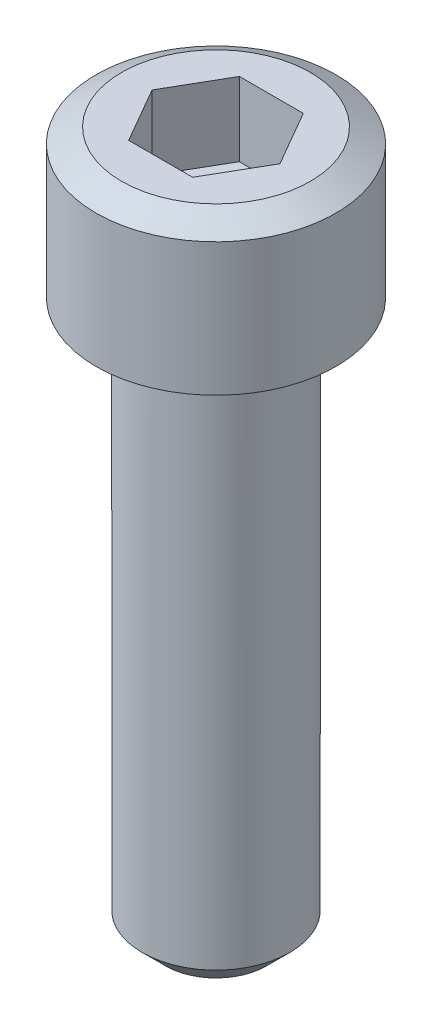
from build123d import *

# Parameters (mm, degrees)
SKETCH_1_R          = 6.5
EXTRUDE_1_DEPTH     = 8
CUT_EXTRUDE_1_DEPTH = 4
CHAMFER_1_SIZE      = 0.8
CHAMFER_1_SIZE2     = 1.385640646
SKETCH_3_R          = 4
EXTRUDE_2_DEPTH     = 30
CHAMFER_2_SIZE      = 1.25


with BuildPart() as part:
    # Sketch 1 → Extrude 1 (new body)
    with BuildSketch(Plane(origin=(0, 0, 0), x_dir=(1, 0, 0), z_dir=(0, 1, 0))):
        with Locations(Location((0, 0, 0), (0, 0, 270))):
            Circle(SKETCH_1_R)
    extrude(amount=EXTRUDE_1_DEPTH)

    # Sketch 2 → Cut-Extrude 1 (cut)
    with BuildSketch(Plane(origin=(0, 8, 0), x_dir=(-1, 0, 0), z_dir=(0, 1, 0))):
        Polygon((-3.464101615, 0), (-1.732050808, -3), (1.732050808, -3), (3.464101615, 0), (1.732050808, 3), (-1.732050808, 3), align=None)
    extrude(amount=-CUT_EXTRUDE_1_DEPTH, mode=Mode.SUBTRACT)

    # Chamfer 1
    chamfer_1_edges = [part.edges().sort_by_distance(p)[0] for p in [
        (0, 8, -6.5),
    ]]
    chamfer_1_side = [part.faces().sort_by_distance(p)[0] for p in [
        (0, 4, -6.5),
    ]]
    chamfer(chamfer_1_edges, length=CHAMFER_1_SIZE, length2=CHAMFER_1_SIZE2, reference=chamfer_1_side[0])

    # Sketch 3 → Extrude 2 (add)
    with BuildSketch(Plane.XZ):
        with Locations(Location((0, 0, 0), (0, 0, 90))):
            Circle(SKETCH_3_R)
    extrude(amount=EXTRUDE_2_DEPTH)

    # Chamfer 2
    chamfer_2_edges = [part.edges().sort_by_distance(p)[0] for p in [
        (0, -30, -4),
    ]]
    chamfer(chamfer_2_edges, length=CHAMFER_2_SIZE)


solid = part.part
